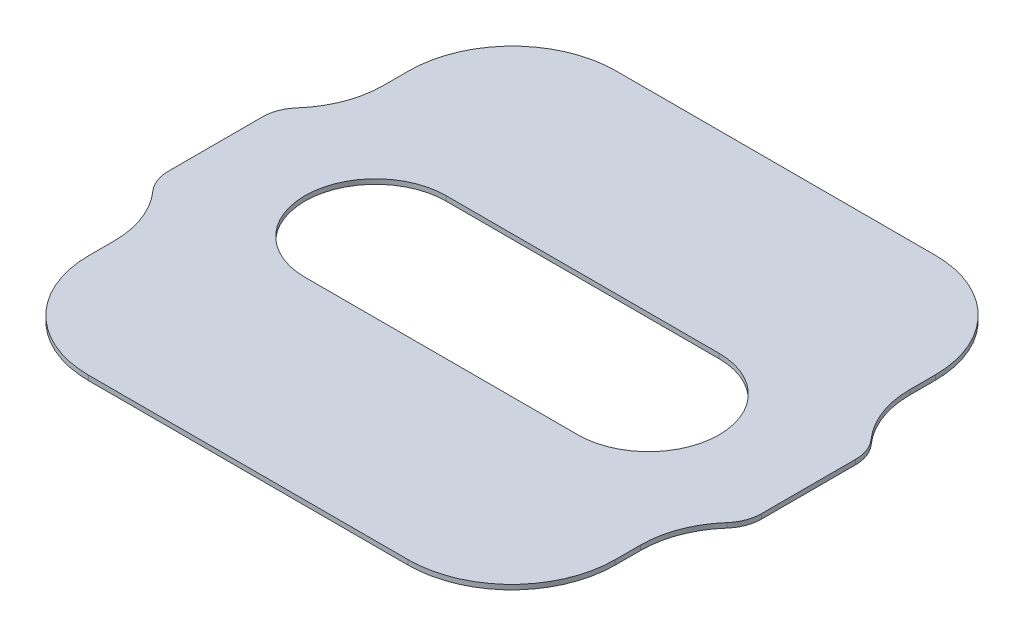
from build123d import *

# Parameters (mm, degrees)
BOSS_EXTRUDE3_DEPTH = 0.0508
CUT_EXTRUDE2_DEPTH  = 24.721164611


with BuildPart() as part:
    # Sketch3 → Boss-Extrude3 (new body)
    with BuildSketch(Plane(origin=(0, 0, 0), x_dir=(1, 0, 0), z_dir=(0, 1, 0))):
        with BuildLine():
            Line((20.641488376, -3.030751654), (17.249062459, -3.030751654))
            ThreePointArc((17.249062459, -3.030751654), (16.471324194, -3.352855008), (16.149062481, -4.130527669))
            Line((16.149062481, -4.130527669), (16.149007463, -4.400727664))
            ThreePointArc((16.149007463, -4.400727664), (16.083672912, -4.756052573), (15.896341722, -5.064972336))
            ThreePointArc((15.896341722, -5.064972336), (15.821394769, -5.188578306), (15.795275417, -5.330751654))
            Line((15.795275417, -5.330751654), (15.795275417, -6.330751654))
            ThreePointArc((15.795275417, -6.330751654), (15.821394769, -6.472925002), (15.896341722, -6.596530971))
            ThreePointArc((15.896341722, -6.596530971), (16.083672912, -6.905450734), (16.149007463, -7.260775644))
            Line((16.149007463, -7.260775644), (16.149062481, -7.530975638))
            ThreePointArc((16.149062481, -7.530975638), (16.471324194, -8.308648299), (17.249062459, -8.630751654))
            Line((17.249062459, -8.630751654), (20.641488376, -8.630751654))
            ThreePointArc((20.641488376, -8.630751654), (21.419226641, -8.308648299), (21.741488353, -7.530975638))
            Line((21.741488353, -7.530975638), (21.741543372, -7.260775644))
            ThreePointArc((21.741543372, -7.260775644), (21.806877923, -6.905450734), (21.994209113, -6.596530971))
            ThreePointArc((21.994209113, -6.596530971), (22.069156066, -6.472925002), (22.095275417, -6.330751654))
            Line((22.095275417, -6.330751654), (22.095275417, -5.330751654))
            ThreePointArc((22.095275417, -5.330751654), (22.069156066, -5.188578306), (21.994209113, -5.064972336))
            ThreePointArc((21.994209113, -5.064972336), (21.806877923, -4.756052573), (21.741543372, -4.400727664))
            Line((21.741543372, -4.400727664), (21.741488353, -4.130527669))
            ThreePointArc((21.741488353, -4.130527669), (21.419226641, -3.352855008), (20.641488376, -3.030751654))
        make_face()
    extrude(amount=BOSS_EXTRUDE3_DEPTH)

    # Sketch4 → Cut-Extrude2 (cut, through all)
    with BuildSketch(Plane(origin=(0, 0.0508, 0), x_dir=(1, 0, 0), z_dir=(0, 1, 0))):
        with BuildLine():
            Line((17.495275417, -5.080751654), (20.395275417, -5.080751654))
            ThreePointArc((20.395275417, -5.080751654), (21.145275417, -5.830751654), (20.395275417, -6.580751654))
            Line((20.395275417, -6.580751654), (17.495275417, -6.580751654))
            ThreePointArc((17.495275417, -6.580751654), (16.745275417, -5.830751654), (17.495275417, -5.080751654))
        make_face()
    extrude(amount=-CUT_EXTRUDE2_DEPTH, mode=Mode.SUBTRACT)


solid = part.part
